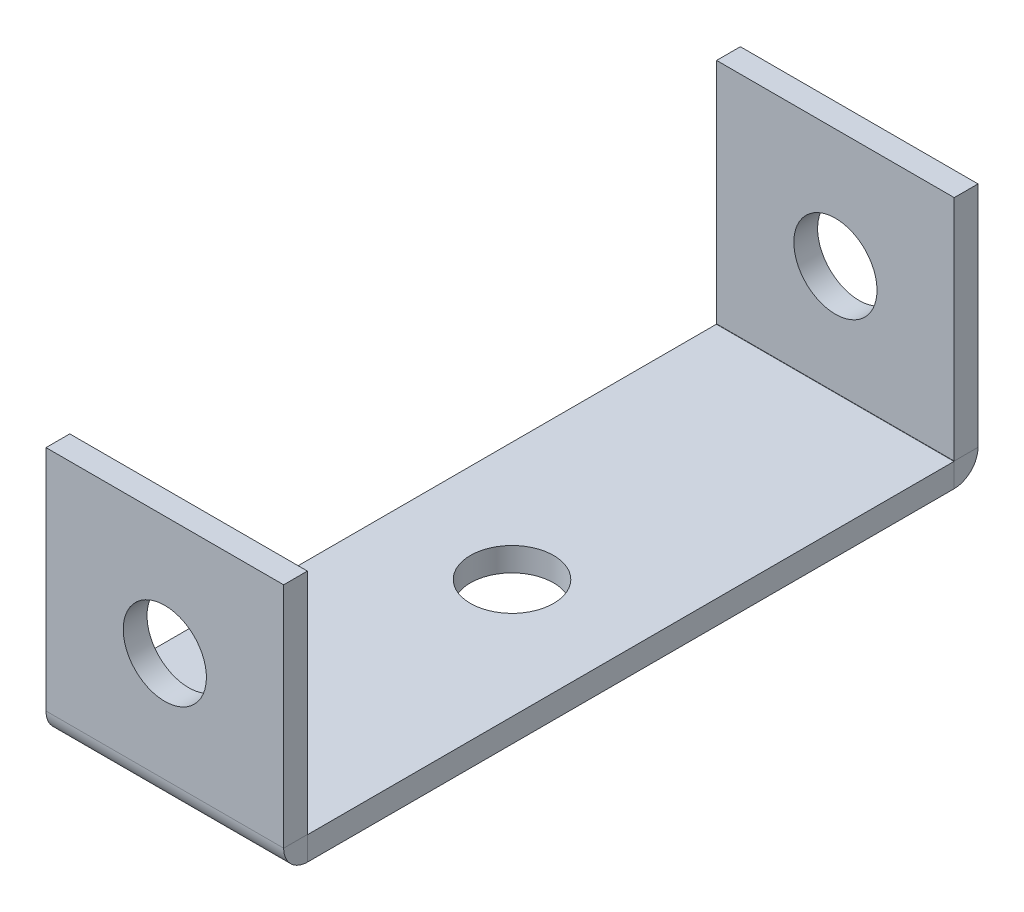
ISO-10303-21;
HEADER;
FILE_DESCRIPTION(('STEP AP214'),'2;1');
FILE_NAME('part.step','',(''),(''),'','','');
FILE_SCHEMA(('AUTOMOTIVE_DESIGN { 1 0 10303 214 1 1 1 1 }'));
ENDSEC;
DATA;
#1=APPLICATION_CONTEXT('core data for automotive mechanical design processes');
#2=APPLICATION_PROTOCOL_DEFINITION('international standard','automotive_design',2000,#1);
#3=PRODUCT_CONTEXT('',#1,'mechanical');
#4=PRODUCT('Part','Part','',(#3));
#5=PRODUCT_RELATED_PRODUCT_CATEGORY('part','',(#4));
#6=PRODUCT_DEFINITION_FORMATION('','',#4);
#7=PRODUCT_DEFINITION_CONTEXT('part definition',#1,'design');
#8=PRODUCT_DEFINITION('design','',#6,#7);
#9=PRODUCT_DEFINITION_SHAPE('','',#8);
#10=(LENGTH_UNIT() NAMED_UNIT(*) SI_UNIT(.MILLI.,.METRE.));
#11=(NAMED_UNIT(*) PLANE_ANGLE_UNIT() SI_UNIT($,.RADIAN.));
#12=(NAMED_UNIT(*) SI_UNIT($,.STERADIAN.) SOLID_ANGLE_UNIT());
#13=UNCERTAINTY_MEASURE_WITH_UNIT(LENGTH_MEASURE(1.E-05),#10,'distance_accuracy_value','');
#14=(GEOMETRIC_REPRESENTATION_CONTEXT(3) GLOBAL_UNCERTAINTY_ASSIGNED_CONTEXT((#13)) GLOBAL_UNIT_ASSIGNED_CONTEXT((#10,
#11,#12)) REPRESENTATION_CONTEXT('',''));
#15=CARTESIAN_POINT('',(0.,0.,0.));
#16=DIRECTION('',(0.,0.,1.));
#17=DIRECTION('',(1.,0.,0.));
#18=AXIS2_PLACEMENT_3D('',#15,#16,#17);
#19=CARTESIAN_POINT('',(0.,0.,-48.));
#20=DIRECTION('',(0.,-1.,0.));
#21=DIRECTION('',(0.,0.,-1.));
#22=AXIS2_PLACEMENT_3D('',#19,#20,#21);
#23=PLANE('',#22);
#24=CARTESIAN_POINT('',(5.,0.,-24.));
#25=DIRECTION('',(0.,1.,0.));
#26=DIRECTION('',(0.,0.,1.));
#27=AXIS2_PLACEMENT_3D('',#24,#25,#26);
#28=CIRCLE('',#27,1.75);
#29=CARTESIAN_POINT('',(5.,0.,-22.25));
#30=VERTEX_POINT('',#29);
#31=EDGE_CURVE('E226',#30,#30,#28,.T.);
#32=ORIENTED_EDGE('',*,*,#31,.T.);
#33=EDGE_LOOP('',(#32));
#34=FACE_BOUND('',#33,.T.);
#35=DIRECTION('',(0.,0.,1.));
#36=VECTOR('',#35,1.);
#37=CARTESIAN_POINT('',(0.,0.,0.));
#38=LINE('',#37,#36);
#39=CARTESIAN_POINT('',(0.,0.,-37.5994469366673));
#40=VERTEX_POINT('',#39);
#41=CARTESIAN_POINT('',(0.,7.28031480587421E-09,-10.4005530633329));
#42=VERTEX_POINT('',#41);
#43=EDGE_CURVE('E57',#40,#42,#38,.T.);
#44=ORIENTED_EDGE('',*,*,#43,.F.);
#45=DIRECTION('',(1.,0.,0.));
#46=VECTOR('',#45,1.);
#47=CARTESIAN_POINT('',(0.,0.,-37.5994469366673));
#48=LINE('',#47,#46);
#49=CARTESIAN_POINT('',(10.,0.,-37.5994469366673));
#50=VERTEX_POINT('',#49);
#51=EDGE_CURVE('E49',#40,#50,#48,.T.);
#52=ORIENTED_EDGE('',*,*,#51,.T.);
#53=DIRECTION('',(0.,0.,-1.));
#54=VECTOR('',#53,1.);
#55=CARTESIAN_POINT('',(10.,0.,0.));
#56=LINE('',#55,#54);
#57=CARTESIAN_POINT('',(10.,0.,-10.4005530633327));
#58=VERTEX_POINT('',#57);
#59=EDGE_CURVE('E65',#58,#50,#56,.T.);
#60=ORIENTED_EDGE('',*,*,#59,.F.);
#61=DIRECTION('',(1.,0.,0.));
#62=VECTOR('',#61,1.);
#63=CARTESIAN_POINT('',(0.,0.,-10.4005530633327));
#64=LINE('',#63,#62);
#65=EDGE_CURVE('E239',#42,#58,#64,.T.);
#66=ORIENTED_EDGE('',*,*,#65,.F.);
#67=EDGE_LOOP('',(#44,#52,#60,#66));
#68=FACE_BOUND('',#67,.T.);
#69=ADVANCED_FACE('F40',(#34,#68),#23,.T.);
#70=CARTESIAN_POINT('',(10.,1.,0.));
#71=DIRECTION('',(-1.,0.,0.));
#72=DIRECTION('',(0.,0.,1.));
#73=AXIS2_PLACEMENT_3D('',#70,#71,#72);
#74=PLANE('',#73);
#75=DIRECTION('',(0.,-1.,0.));
#76=VECTOR('',#75,1.);
#77=CARTESIAN_POINT('',(10.,0.999999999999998,-37.5994469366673));
#78=LINE('',#77,#76);
#79=CARTESIAN_POINT('',(10.,1.,-37.5994469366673));
#80=VERTEX_POINT('',#79);
#81=EDGE_CURVE('E246',#80,#50,#78,.T.);
#82=ORIENTED_EDGE('',*,*,#81,.F.);
#83=DIRECTION('',(0.,0.,-1.));
#84=VECTOR('',#83,1.);
#85=CARTESIAN_POINT('',(10.,1.,0.));
#86=LINE('',#85,#84);
#87=CARTESIAN_POINT('',(10.,1.00000000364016,-10.4005530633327));
#88=VERTEX_POINT('',#87);
#89=EDGE_CURVE('E236',#88,#80,#86,.T.);
#90=ORIENTED_EDGE('',*,*,#89,.F.);
#91=DIRECTION('',(0.,-1.,0.));
#92=VECTOR('',#91,1.);
#93=CARTESIAN_POINT('',(10.,0.999999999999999,-10.4005530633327));
#94=LINE('',#93,#92);
#95=EDGE_CURVE('E241',#88,#58,#94,.T.);
#96=ORIENTED_EDGE('',*,*,#95,.T.);
#97=ORIENTED_EDGE('',*,*,#59,.T.);
#98=EDGE_LOOP('',(#82,#90,#96,#97));
#99=FACE_BOUND('',#98,.T.);
#100=ADVANCED_FACE('F295',(#99),#74,.F.);
#101=CARTESIAN_POINT('',(0.,1.,0.));
#102=DIRECTION('',(1.,0.,0.));
#103=DIRECTION('',(0.,0.,-1.));
#104=AXIS2_PLACEMENT_3D('',#101,#102,#103);
#105=PLANE('',#104);
#106=DIRECTION('',(0.,1.,0.));
#107=VECTOR('',#106,1.);
#108=CARTESIAN_POINT('',(0.,0.999999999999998,-37.5994469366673));
#109=LINE('',#108,#107);
#110=CARTESIAN_POINT('',(0.,0.999999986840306,-37.5994469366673));
#111=VERTEX_POINT('',#110);
#112=EDGE_CURVE('E12',#40,#111,#109,.T.);
#113=ORIENTED_EDGE('',*,*,#112,.F.);
#114=ORIENTED_EDGE('',*,*,#43,.T.);
#115=DIRECTION('',(0.,1.,0.));
#116=VECTOR('',#115,1.);
#117=CARTESIAN_POINT('',(0.,0.999999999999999,-10.4005530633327));
#118=LINE('',#117,#116);
#119=CARTESIAN_POINT('',(0.,1.00000000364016,-10.4005530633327));
#120=VERTEX_POINT('',#119);
#121=EDGE_CURVE('E235',#42,#120,#118,.T.);
#122=ORIENTED_EDGE('',*,*,#121,.T.);
#123=DIRECTION('',(0.,0.,1.));
#124=VECTOR('',#123,1.);
#125=CARTESIAN_POINT('',(0.,1.,0.));
#126=LINE('',#125,#124);
#127=EDGE_CURVE('E44',#111,#120,#126,.T.);
#128=ORIENTED_EDGE('',*,*,#127,.F.);
#129=EDGE_LOOP('',(#113,#114,#122,#128));
#130=FACE_BOUND('',#129,.T.);
#131=ADVANCED_FACE('F42',(#130),#105,.F.);
#132=CARTESIAN_POINT('',(0.,1.,-48.));
#133=DIRECTION('',(0.,-1.,0.));
#134=DIRECTION('',(0.,0.,-1.));
#135=AXIS2_PLACEMENT_3D('',#132,#133,#134);
#136=PLANE('',#135);
#137=DIRECTION('',(1.,0.,0.));
#138=VECTOR('',#137,1.);
#139=CARTESIAN_POINT('',(0.,1.,-37.5994469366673));
#140=LINE('',#139,#138);
#141=EDGE_CURVE('E243',#111,#80,#140,.T.);
#142=ORIENTED_EDGE('',*,*,#141,.F.);
#143=ORIENTED_EDGE('',*,*,#127,.T.);
#144=DIRECTION('',(1.,0.,0.));
#145=VECTOR('',#144,1.);
#146=CARTESIAN_POINT('',(0.,1.,-10.4005530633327));
#147=LINE('',#146,#145);
#148=EDGE_CURVE('E232',#120,#88,#147,.T.);
#149=ORIENTED_EDGE('',*,*,#148,.T.);
#150=ORIENTED_EDGE('',*,*,#89,.T.);
#151=EDGE_LOOP('',(#142,#143,#149,#150));
#152=FACE_BOUND('',#151,.T.);
#153=CARTESIAN_POINT('',(5.,1.,-24.));
#154=DIRECTION('',(0.,1.,0.));
#155=DIRECTION('',(0.,0.,1.));
#156=AXIS2_PLACEMENT_3D('',#153,#154,#155);
#157=CIRCLE('',#156,1.75);
#158=CARTESIAN_POINT('',(5.,1.,-22.25));
#159=VERTEX_POINT('',#158);
#160=EDGE_CURVE('E229',#159,#159,#157,.T.);
#161=ORIENTED_EDGE('',*,*,#160,.F.);
#162=EDGE_LOOP('',(#161));
#163=FACE_BOUND('',#162,.T.);
#164=ADVANCED_FACE('F255',(#152,#163),#136,.F.);
#165=CARTESIAN_POINT('',(5.,1.,-24.));
#166=DIRECTION('',(0.,-1.,0.));
#167=DIRECTION('',(0.,0.,-1.));
#168=AXIS2_PLACEMENT_3D('',#165,#166,#167);
#169=CYLINDRICAL_SURFACE('',#168,1.75);
#170=ORIENTED_EDGE('',*,*,#160,.T.);
#171=EDGE_LOOP('',(#170));
#172=FACE_BOUND('',#171,.T.);
#173=ORIENTED_EDGE('',*,*,#31,.F.);
#174=EDGE_LOOP('',(#173));
#175=FACE_BOUND('',#174,.T.);
#176=ADVANCED_FACE('F304',(#172,#175),#169,.F.);
#177=CARTESIAN_POINT('',(0.,1.00999999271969,-10.4005530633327));
#178=DIRECTION('',(1.,0.,0.));
#179=DIRECTION('',(0.,0.,-1.));
#180=AXIS2_PLACEMENT_3D('',#177,#178,#179);
#181=PLANE('',#180);
#182=ORIENTED_EDGE('',*,*,#121,.F.);
#183=CARTESIAN_POINT('',(0.,1.01,-10.4005530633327));
#184=DIRECTION('',(1.,0.,0.));
#185=DIRECTION('',(0.,0.,-1.));
#186=AXIS2_PLACEMENT_3D('',#183,#184,#185);
#187=CIRCLE('',#186,1.00999999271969);
#188=CARTESIAN_POINT('',(0.,1.01,-9.3905530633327));
#189=VERTEX_POINT('',#188);
#190=EDGE_CURVE('E180',#42,#189,#187,.F.);
#191=ORIENTED_EDGE('',*,*,#190,.T.);
#192=DIRECTION('',(0.,0.,-1.));
#193=VECTOR('',#192,1.);
#194=CARTESIAN_POINT('',(0.,1.01,-10.3905530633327));
#195=LINE('',#194,#193);
#196=CARTESIAN_POINT('',(0.,1.01,-10.3905530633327));
#197=VERTEX_POINT('',#196);
#198=EDGE_CURVE('E207',#189,#197,#195,.T.);
#199=ORIENTED_EDGE('',*,*,#198,.T.);
#200=CARTESIAN_POINT('',(0.,1.00999999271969,-10.4005530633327));
#201=DIRECTION('',(-1.,0.,0.));
#202=DIRECTION('',(0.,0.,1.));
#203=AXIS2_PLACEMENT_3D('',#200,#201,#202);
#204=CIRCLE('',#203,0.00999998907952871);
#205=EDGE_CURVE('E218',#120,#197,#204,.T.);
#206=ORIENTED_EDGE('',*,*,#205,.F.);
#207=EDGE_LOOP('',(#182,#191,#199,#206));
#208=FACE_BOUND('',#207,.T.);
#209=ADVANCED_FACE('F261',(#208),#181,.F.);
#210=CARTESIAN_POINT('',(10.,1.00999999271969,-10.4005530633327));
#211=DIRECTION('',(-1.,0.,0.));
#212=DIRECTION('',(0.,0.,1.));
#213=AXIS2_PLACEMENT_3D('',#210,#211,#212);
#214=PLANE('',#213);
#215=DIRECTION('',(0.,0.,1.));
#216=VECTOR('',#215,1.);
#217=CARTESIAN_POINT('',(10.,1.01,-10.3905530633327));
#218=LINE('',#217,#216);
#219=CARTESIAN_POINT('',(10.,1.01,-10.390553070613));
#220=VERTEX_POINT('',#219);
#221=CARTESIAN_POINT('',(10.,1.01,-9.3905530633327));
#222=VERTEX_POINT('',#221);
#223=EDGE_CURVE('E210',#220,#222,#218,.T.);
#224=ORIENTED_EDGE('',*,*,#223,.T.);
#225=CARTESIAN_POINT('',(10.,1.01,-10.4005530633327));
#226=DIRECTION('',(1.,0.,0.));
#227=DIRECTION('',(0.,0.,-1.));
#228=AXIS2_PLACEMENT_3D('',#225,#226,#227);
#229=CIRCLE('',#228,1.00999999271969);
#230=EDGE_CURVE('E215',#222,#58,#229,.T.);
#231=ORIENTED_EDGE('',*,*,#230,.T.);
#232=ORIENTED_EDGE('',*,*,#95,.F.);
#233=CARTESIAN_POINT('',(10.,1.00999999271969,-10.4005530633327));
#234=DIRECTION('',(1.,0.,0.));
#235=DIRECTION('',(0.,0.,-1.));
#236=AXIS2_PLACEMENT_3D('',#233,#234,#235);
#237=CIRCLE('',#236,0.00999998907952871);
#238=EDGE_CURVE('E223',#220,#88,#237,.T.);
#239=ORIENTED_EDGE('',*,*,#238,.F.);
#240=EDGE_LOOP('',(#224,#231,#232,#239));
#241=FACE_BOUND('',#240,.T.);
#242=ADVANCED_FACE('F273',(#241),#214,.F.);
#243=CARTESIAN_POINT('',(-5.08175436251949,1.01,-10.4005530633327));
#244=DIRECTION('',(1.,0.,0.));
#245=DIRECTION('',(0.,0.,-1.));
#246=AXIS2_PLACEMENT_3D('',#243,#244,#245);
#247=CYLINDRICAL_SURFACE('',#246,0.00999999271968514);
#248=ORIENTED_EDGE('',*,*,#238,.T.);
#249=ORIENTED_EDGE('',*,*,#148,.F.);
#250=ORIENTED_EDGE('',*,*,#205,.T.);
#251=DIRECTION('',(1.,0.,0.));
#252=VECTOR('',#251,1.);
#253=CARTESIAN_POINT('',(0.,1.01,-10.3905530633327));
#254=LINE('',#253,#252);
#255=EDGE_CURVE('E177',#197,#220,#254,.T.);
#256=ORIENTED_EDGE('',*,*,#255,.T.);
#257=EDGE_LOOP('',(#248,#249,#250,#256));
#258=FACE_BOUND('',#257,.T.);
#259=ADVANCED_FACE('F284',(#258),#247,.F.);
#260=CARTESIAN_POINT('',(-5.08175436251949,1.01,-10.4005530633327));
#261=DIRECTION('',(1.,0.,0.));
#262=DIRECTION('',(0.,0.,-1.));
#263=AXIS2_PLACEMENT_3D('',#260,#261,#262);
#264=CYLINDRICAL_SURFACE('',#263,1.00999999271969);
#265=ORIENTED_EDGE('',*,*,#230,.F.);
#266=DIRECTION('',(1.,0.,0.));
#267=VECTOR('',#266,1.);
#268=CARTESIAN_POINT('',(0.,1.01,-9.3905530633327));
#269=LINE('',#268,#267);
#270=EDGE_CURVE('E184',#189,#222,#269,.T.);
#271=ORIENTED_EDGE('',*,*,#270,.F.);
#272=ORIENTED_EDGE('',*,*,#190,.F.);
#273=ORIENTED_EDGE('',*,*,#65,.T.);
#274=EDGE_LOOP('',(#265,#271,#272,#273));
#275=FACE_BOUND('',#274,.T.);
#276=ADVANCED_FACE('F265',(#275),#264,.T.);
#277=CARTESIAN_POINT('',(5.,5.6094469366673,-10.3905530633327));
#278=DIRECTION('',(0.,0.,1.));
#279=DIRECTION('',(0.,-1.,0.));
#280=AXIS2_PLACEMENT_3D('',#277,#278,#279);
#281=CYLINDRICAL_SURFACE('',#280,1.75);
#282=CARTESIAN_POINT('',(5.,5.6094469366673,-10.3905530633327));
#283=DIRECTION('',(0.,0.,-1.));
#284=DIRECTION('',(0.,1.,0.));
#285=AXIS2_PLACEMENT_3D('',#282,#283,#284);
#286=CIRCLE('',#285,1.75);
#287=CARTESIAN_POINT('',(5.,7.3594469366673,-10.3905530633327));
#288=VERTEX_POINT('',#287);
#289=EDGE_CURVE('E204',#288,#288,#286,.T.);
#290=ORIENTED_EDGE('',*,*,#289,.T.);
#291=EDGE_LOOP('',(#290));
#292=FACE_BOUND('',#291,.T.);
#293=CARTESIAN_POINT('',(5.,5.60944693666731,-9.39055306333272));
#294=DIRECTION('',(0.,0.,-1.));
#295=DIRECTION('',(0.,1.,0.));
#296=AXIS2_PLACEMENT_3D('',#293,#294,#295);
#297=CIRCLE('',#296,1.75);
#298=CARTESIAN_POINT('',(5.,7.35944693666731,-9.39055306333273));
#299=VERTEX_POINT('',#298);
#300=EDGE_CURVE('E187',#299,#299,#297,.T.);
#301=ORIENTED_EDGE('',*,*,#300,.F.);
#302=EDGE_LOOP('',(#301));
#303=FACE_BOUND('',#302,.T.);
#304=ADVANCED_FACE('F291',(#292,#303),#281,.F.);
#305=CARTESIAN_POINT('',(0.,10.6094469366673,-10.3905530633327));
#306=DIRECTION('',(0.,-1.,0.));
#307=DIRECTION('',(-1.,0.,0.));
#308=AXIS2_PLACEMENT_3D('',#305,#306,#307);
#309=PLANE('',#308);
#310=DIRECTION('',(1.,0.,0.));
#311=VECTOR('',#310,1.);
#312=CARTESIAN_POINT('',(0.,10.6094469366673,-9.39055306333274));
#313=LINE('',#312,#311);
#314=CARTESIAN_POINT('',(0.,10.6094469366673,-9.39055306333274));
#315=VERTEX_POINT('',#314);
#316=CARTESIAN_POINT('',(10.,10.6094469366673,-9.39055306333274));
#317=VERTEX_POINT('',#316);
#318=EDGE_CURVE('E202',#315,#317,#313,.T.);
#319=ORIENTED_EDGE('',*,*,#318,.T.);
#320=DIRECTION('',(0.,0.,1.));
#321=VECTOR('',#320,1.);
#322=CARTESIAN_POINT('',(10.,10.6094469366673,-10.3905530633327));
#323=LINE('',#322,#321);
#324=CARTESIAN_POINT('',(10.,10.6094469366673,-10.3905530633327));
#325=VERTEX_POINT('',#324);
#326=EDGE_CURVE('E181',#325,#317,#323,.T.);
#327=ORIENTED_EDGE('',*,*,#326,.F.);
#328=DIRECTION('',(1.,0.,0.));
#329=VECTOR('',#328,1.);
#330=CARTESIAN_POINT('',(0.,10.6094469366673,-10.3905530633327));
#331=LINE('',#330,#329);
#332=CARTESIAN_POINT('',(0.,10.6094469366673,-10.3905530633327));
#333=VERTEX_POINT('',#332);
#334=EDGE_CURVE('E195',#333,#325,#331,.T.);
#335=ORIENTED_EDGE('',*,*,#334,.F.);
#336=DIRECTION('',(0.,0.,1.));
#337=VECTOR('',#336,1.);
#338=CARTESIAN_POINT('',(0.,10.6094469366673,-10.3905530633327));
#339=LINE('',#338,#337);
#340=EDGE_CURVE('E199',#333,#315,#339,.T.);
#341=ORIENTED_EDGE('',*,*,#340,.T.);
#342=EDGE_LOOP('',(#319,#327,#335,#341));
#343=FACE_BOUND('',#342,.T.);
#344=ADVANCED_FACE('F341',(#343),#309,.F.);
#345=CARTESIAN_POINT('',(0.,-37.3905530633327,-10.3905530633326));
#346=DIRECTION('',(0.,0.,1.));
#347=DIRECTION('',(0.,-1.,0.));
#348=AXIS2_PLACEMENT_3D('',#345,#346,#347);
#349=PLANE('',#348);
#350=ORIENTED_EDGE('',*,*,#255,.F.);
#351=DIRECTION('',(0.,1.,0.));
#352=VECTOR('',#351,1.);
#353=CARTESIAN_POINT('',(0.,10.6094469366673,-10.3905530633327));
#354=LINE('',#353,#352);
#355=EDGE_CURVE('E197',#197,#333,#354,.T.);
#356=ORIENTED_EDGE('',*,*,#355,.T.);
#357=ORIENTED_EDGE('',*,*,#334,.T.);
#358=DIRECTION('',(0.,-1.,0.));
#359=VECTOR('',#358,1.);
#360=CARTESIAN_POINT('',(10.,10.6094469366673,-10.3905530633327));
#361=LINE('',#360,#359);
#362=EDGE_CURVE('E192',#325,#220,#361,.T.);
#363=ORIENTED_EDGE('',*,*,#362,.T.);
#364=EDGE_LOOP('',(#350,#356,#357,#363));
#365=FACE_BOUND('',#364,.T.);
#366=ORIENTED_EDGE('',*,*,#289,.F.);
#367=EDGE_LOOP('',(#366));
#368=FACE_BOUND('',#367,.T.);
#369=ADVANCED_FACE('F278',(#365,#368),#349,.F.);
#370=CARTESIAN_POINT('',(0.,10.6094469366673,-10.3905530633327));
#371=DIRECTION('',(1.,0.,0.));
#372=DIRECTION('',(0.,-1.,0.));
#373=AXIS2_PLACEMENT_3D('',#370,#371,#372);
#374=PLANE('',#373);
#375=ORIENTED_EDGE('',*,*,#198,.F.);
#376=DIRECTION('',(0.,1.,0.));
#377=VECTOR('',#376,1.);
#378=CARTESIAN_POINT('',(0.,10.6094469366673,-9.39055306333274));
#379=LINE('',#378,#377);
#380=EDGE_CURVE('E190',#189,#315,#379,.T.);
#381=ORIENTED_EDGE('',*,*,#380,.T.);
#382=ORIENTED_EDGE('',*,*,#340,.F.);
#383=ORIENTED_EDGE('',*,*,#355,.F.);
#384=EDGE_LOOP('',(#375,#381,#382,#383));
#385=FACE_BOUND('',#384,.T.);
#386=ADVANCED_FACE('F363',(#385),#374,.F.);
#387=CARTESIAN_POINT('',(0.,-37.3905530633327,-9.39055306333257));
#388=DIRECTION('',(0.,0.,1.));
#389=DIRECTION('',(0.,-1.,0.));
#390=AXIS2_PLACEMENT_3D('',#387,#388,#389);
#391=PLANE('',#390);
#392=ORIENTED_EDGE('',*,*,#300,.T.);
#393=EDGE_LOOP('',(#392));
#394=FACE_BOUND('',#393,.T.);
#395=ORIENTED_EDGE('',*,*,#380,.F.);
#396=ORIENTED_EDGE('',*,*,#270,.T.);
#397=DIRECTION('',(0.,-1.,0.));
#398=VECTOR('',#397,1.);
#399=CARTESIAN_POINT('',(10.,10.6094469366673,-9.39055306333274));
#400=LINE('',#399,#398);
#401=EDGE_CURVE('E178',#317,#222,#400,.T.);
#402=ORIENTED_EDGE('',*,*,#401,.F.);
#403=ORIENTED_EDGE('',*,*,#318,.F.);
#404=EDGE_LOOP('',(#395,#396,#402,#403));
#405=FACE_BOUND('',#404,.T.);
#406=ADVANCED_FACE('F268',(#394,#405),#391,.T.);
#407=CARTESIAN_POINT('',(10.,10.6094469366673,-10.3905530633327));
#408=DIRECTION('',(-1.,0.,0.));
#409=DIRECTION('',(0.,1.,0.));
#410=AXIS2_PLACEMENT_3D('',#407,#408,#409);
#411=PLANE('',#410);
#412=ORIENTED_EDGE('',*,*,#223,.F.);
#413=ORIENTED_EDGE('',*,*,#362,.F.);
#414=ORIENTED_EDGE('',*,*,#326,.T.);
#415=ORIENTED_EDGE('',*,*,#401,.T.);
#416=EDGE_LOOP('',(#412,#413,#414,#415));
#417=FACE_BOUND('',#416,.T.);
#418=ADVANCED_FACE('F276',(#417),#411,.F.);
#419=CARTESIAN_POINT('',(0.,1.01000002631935,-37.5994469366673));
#420=DIRECTION('',(1.,0.,0.));
#421=DIRECTION('',(0.,0.,-1.));
#422=AXIS2_PLACEMENT_3D('',#419,#420,#421);
#423=PLANE('',#422);
#424=DIRECTION('',(0.,0.,1.));
#425=VECTOR('',#424,1.);
#426=CARTESIAN_POINT('',(0.,1.01,-37.6094469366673));
#427=LINE('',#426,#425);
#428=CARTESIAN_POINT('',(0.,1.01,-38.6094469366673));
#429=VERTEX_POINT('',#428);
#430=CARTESIAN_POINT('',(0.,1.01,-37.6094469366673));
#431=VERTEX_POINT('',#430);
#432=EDGE_CURVE('E561',#429,#431,#427,.T.);
#433=ORIENTED_EDGE('',*,*,#432,.F.);
#434=CARTESIAN_POINT('',(0.,1.01,-37.5994469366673));
#435=DIRECTION('',(-1.,0.,0.));
#436=DIRECTION('',(0.,0.,1.));
#437=AXIS2_PLACEMENT_3D('',#434,#435,#436);
#438=CIRCLE('',#437,1.01000002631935);
#439=EDGE_CURVE('E168',#429,#40,#438,.T.);
#440=ORIENTED_EDGE('',*,*,#439,.T.);
#441=ORIENTED_EDGE('',*,*,#112,.T.);
#442=CARTESIAN_POINT('',(0.,1.01000002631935,-37.5994469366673));
#443=DIRECTION('',(-1.,0.,0.));
#444=DIRECTION('',(0.,0.,1.));
#445=AXIS2_PLACEMENT_3D('',#442,#443,#444);
#446=CIRCLE('',#445,0.010000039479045);
#447=EDGE_CURVE('E167',#431,#111,#446,.T.);
#448=ORIENTED_EDGE('',*,*,#447,.F.);
#449=EDGE_LOOP('',(#433,#440,#441,#448));
#450=FACE_BOUND('',#449,.T.);
#451=ADVANCED_FACE('F393',(#450),#423,.F.);
#452=CARTESIAN_POINT('',(10.,1.01000002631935,-37.5994469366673));
#453=DIRECTION('',(-1.,0.,0.));
#454=DIRECTION('',(0.,0.,1.));
#455=AXIS2_PLACEMENT_3D('',#452,#453,#454);
#456=PLANE('',#455);
#457=ORIENTED_EDGE('',*,*,#81,.T.);
#458=CARTESIAN_POINT('',(10.,1.01,-37.5994469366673));
#459=DIRECTION('',(-1.,0.,0.));
#460=DIRECTION('',(0.,0.,1.));
#461=AXIS2_PLACEMENT_3D('',#458,#459,#460);
#462=CIRCLE('',#461,1.01000002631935);
#463=CARTESIAN_POINT('',(10.,1.01,-38.6094469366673));
#464=VERTEX_POINT('',#463);
#465=EDGE_CURVE('E165',#50,#464,#462,.F.);
#466=ORIENTED_EDGE('',*,*,#465,.T.);
#467=DIRECTION('',(0.,0.,-1.));
#468=VECTOR('',#467,1.);
#469=CARTESIAN_POINT('',(10.,1.01,-37.6094469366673));
#470=LINE('',#469,#468);
#471=CARTESIAN_POINT('',(10.,1.00999999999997,-37.6094469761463));
#472=VERTEX_POINT('',#471);
#473=EDGE_CURVE('E140',#472,#464,#470,.T.);
#474=ORIENTED_EDGE('',*,*,#473,.F.);
#475=CARTESIAN_POINT('',(10.,1.01000002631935,-37.5994469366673));
#476=DIRECTION('',(1.,0.,0.));
#477=DIRECTION('',(0.,0.,-1.));
#478=AXIS2_PLACEMENT_3D('',#475,#476,#477);
#479=CIRCLE('',#478,0.010000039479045);
#480=EDGE_CURVE('E174',#80,#472,#479,.T.);
#481=ORIENTED_EDGE('',*,*,#480,.F.);
#482=EDGE_LOOP('',(#457,#466,#474,#481));
#483=FACE_BOUND('',#482,.T.);
#484=ADVANCED_FACE('F403',(#483),#456,.F.);
#485=CARTESIAN_POINT('',(15.0817543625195,1.01,-37.5994469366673));
#486=DIRECTION('',(-1.,0.,0.));
#487=DIRECTION('',(0.,0.,1.));
#488=AXIS2_PLACEMENT_3D('',#485,#486,#487);
#489=CYLINDRICAL_SURFACE('',#488,0.0100000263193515);
#490=ORIENTED_EDGE('',*,*,#480,.T.);
#491=DIRECTION('',(1.,0.,0.));
#492=VECTOR('',#491,1.);
#493=CARTESIAN_POINT('',(0.,1.01,-37.6094469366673));
#494=LINE('',#493,#492);
#495=EDGE_CURVE('E571',#431,#472,#494,.T.);
#496=ORIENTED_EDGE('',*,*,#495,.F.);
#497=ORIENTED_EDGE('',*,*,#447,.T.);
#498=ORIENTED_EDGE('',*,*,#141,.T.);
#499=EDGE_LOOP('',(#490,#496,#497,#498));
#500=FACE_BOUND('',#499,.T.);
#501=ADVANCED_FACE('F414',(#500),#489,.F.);
#502=CARTESIAN_POINT('',(15.0817543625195,1.01,-37.5994469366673));
#503=DIRECTION('',(-1.,0.,0.));
#504=DIRECTION('',(0.,0.,1.));
#505=AXIS2_PLACEMENT_3D('',#502,#503,#504);
#506=CYLINDRICAL_SURFACE('',#505,1.01000002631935);
#507=ORIENTED_EDGE('',*,*,#465,.F.);
#508=ORIENTED_EDGE('',*,*,#51,.F.);
#509=ORIENTED_EDGE('',*,*,#439,.F.);
#510=DIRECTION('',(1.,0.,0.));
#511=VECTOR('',#510,1.);
#512=CARTESIAN_POINT('',(0.,1.01,-38.6094469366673));
#513=LINE('',#512,#511);
#514=EDGE_CURVE('E159',#429,#464,#513,.T.);
#515=ORIENTED_EDGE('',*,*,#514,.T.);
#516=EDGE_LOOP('',(#507,#508,#509,#515));
#517=FACE_BOUND('',#516,.T.);
#518=ADVANCED_FACE('F425',(#517),#506,.T.);
#519=CARTESIAN_POINT('',(0.,10.6094469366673,-37.6094469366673));
#520=DIRECTION('',(0.,-1.,0.));
#521=DIRECTION('',(1.,0.,0.));
#522=AXIS2_PLACEMENT_3D('',#519,#520,#521);
#523=PLANE('',#522);
#524=DIRECTION('',(-1.,0.,0.));
#525=VECTOR('',#524,1.);
#526=CARTESIAN_POINT('',(0.,10.6094469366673,-38.6094469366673));
#527=LINE('',#526,#525);
#528=CARTESIAN_POINT('',(10.,10.6094469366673,-38.6094469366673));
#529=VERTEX_POINT('',#528);
#530=CARTESIAN_POINT('',(0.,10.6094469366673,-38.6094469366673));
#531=VERTEX_POINT('',#530);
#532=EDGE_CURVE('E150',#529,#531,#527,.T.);
#533=ORIENTED_EDGE('',*,*,#532,.T.);
#534=DIRECTION('',(0.,0.,-1.));
#535=VECTOR('',#534,1.);
#536=CARTESIAN_POINT('',(0.,10.6094469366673,-37.6094469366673));
#537=LINE('',#536,#535);
#538=CARTESIAN_POINT('',(0.,10.6094469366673,-37.6094469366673));
#539=VERTEX_POINT('',#538);
#540=EDGE_CURVE('E171',#539,#531,#537,.T.);
#541=ORIENTED_EDGE('',*,*,#540,.F.);
#542=DIRECTION('',(-1.,0.,0.));
#543=VECTOR('',#542,1.);
#544=CARTESIAN_POINT('',(0.,10.6094469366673,-37.6094469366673));
#545=LINE('',#544,#543);
#546=CARTESIAN_POINT('',(10.,10.6094469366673,-37.6094469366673));
#547=VERTEX_POINT('',#546);
#548=EDGE_CURVE('E152',#547,#539,#545,.T.);
#549=ORIENTED_EDGE('',*,*,#548,.F.);
#550=DIRECTION('',(0.,0.,-1.));
#551=VECTOR('',#550,1.);
#552=CARTESIAN_POINT('',(10.,10.6094469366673,-37.6094469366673));
#553=LINE('',#552,#551);
#554=EDGE_CURVE('E137',#547,#529,#553,.T.);
#555=ORIENTED_EDGE('',*,*,#554,.T.);
#556=EDGE_LOOP('',(#533,#541,#549,#555));
#557=FACE_BOUND('',#556,.T.);
#558=ADVANCED_FACE('F148',(#557),#523,.F.);
#559=CARTESIAN_POINT('',(5.,5.6094469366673,-37.6094469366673));
#560=DIRECTION('',(0.,0.,-1.));
#561=DIRECTION('',(0.,1.,0.));
#562=AXIS2_PLACEMENT_3D('',#559,#560,#561);
#563=CYLINDRICAL_SURFACE('',#562,1.75);
#564=CARTESIAN_POINT('',(5.,5.6094469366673,-37.6094469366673));
#565=DIRECTION('',(0.,0.,1.));
#566=DIRECTION('',(0.,-1.,0.));
#567=AXIS2_PLACEMENT_3D('',#564,#565,#566);
#568=CIRCLE('',#567,1.75);
#569=CARTESIAN_POINT('',(5.,3.8594469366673,-37.6094469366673));
#570=VERTEX_POINT('',#569);
#571=EDGE_CURVE('E153',#570,#570,#568,.T.);
#572=ORIENTED_EDGE('',*,*,#571,.T.);
#573=EDGE_LOOP('',(#572));
#574=FACE_BOUND('',#573,.T.);
#575=CARTESIAN_POINT('',(5.,5.60944693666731,-38.6094469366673));
#576=DIRECTION('',(0.,0.,1.));
#577=DIRECTION('',(0.,-1.,0.));
#578=AXIS2_PLACEMENT_3D('',#575,#576,#577);
#579=CIRCLE('',#578,1.75);
#580=CARTESIAN_POINT('',(5.,3.85944693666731,-38.6094469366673));
#581=VERTEX_POINT('',#580);
#582=EDGE_CURVE('E145',#581,#581,#579,.T.);
#583=ORIENTED_EDGE('',*,*,#582,.F.);
#584=EDGE_LOOP('',(#583));
#585=FACE_BOUND('',#584,.T.);
#586=ADVANCED_FACE('F446',(#574,#585),#563,.F.);
#587=CARTESIAN_POINT('',(0.,10.6094469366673,-37.6094469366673));
#588=DIRECTION('',(0.,0.,-1.));
#589=DIRECTION('',(0.,1.,0.));
#590=AXIS2_PLACEMENT_3D('',#587,#588,#589);
#591=PLANE('',#590);
#592=ORIENTED_EDGE('',*,*,#571,.F.);
#593=EDGE_LOOP('',(#592));
#594=FACE_BOUND('',#593,.T.);
#595=DIRECTION('',(0.,-1.,0.));
#596=VECTOR('',#595,1.);
#597=CARTESIAN_POINT('',(0.,-37.3905530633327,-37.6094469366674));
#598=LINE('',#597,#596);
#599=EDGE_CURVE('E574',#539,#431,#598,.T.);
#600=ORIENTED_EDGE('',*,*,#599,.T.);
#601=ORIENTED_EDGE('',*,*,#495,.T.);
#602=DIRECTION('',(0.,1.,0.));
#603=VECTOR('',#602,1.);
#604=CARTESIAN_POINT('',(10.,-37.3905530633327,-37.6094469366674));
#605=LINE('',#604,#603);
#606=EDGE_CURVE('E573',#472,#547,#605,.T.);
#607=ORIENTED_EDGE('',*,*,#606,.T.);
#608=ORIENTED_EDGE('',*,*,#548,.T.);
#609=EDGE_LOOP('',(#600,#601,#607,#608));
#610=FACE_BOUND('',#609,.T.);
#611=ADVANCED_FACE('F456',(#594,#610),#591,.F.);
#612=CARTESIAN_POINT('',(10.,-37.3905530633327,-37.6094469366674));
#613=DIRECTION('',(-1.,0.,0.));
#614=DIRECTION('',(0.,-1.,0.));
#615=AXIS2_PLACEMENT_3D('',#612,#613,#614);
#616=PLANE('',#615);
#617=ORIENTED_EDGE('',*,*,#606,.F.);
#618=ORIENTED_EDGE('',*,*,#473,.T.);
#619=DIRECTION('',(0.,1.,0.));
#620=VECTOR('',#619,1.);
#621=CARTESIAN_POINT('',(10.,-37.3905530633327,-38.6094469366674));
#622=LINE('',#621,#620);
#623=EDGE_CURVE('E134',#464,#529,#622,.T.);
#624=ORIENTED_EDGE('',*,*,#623,.T.);
#625=ORIENTED_EDGE('',*,*,#554,.F.);
#626=EDGE_LOOP('',(#617,#618,#624,#625));
#627=FACE_BOUND('',#626,.T.);
#628=ADVANCED_FACE('F136',(#627),#616,.F.);
#629=CARTESIAN_POINT('',(0.,10.6094469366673,-38.6094469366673));
#630=DIRECTION('',(0.,0.,-1.));
#631=DIRECTION('',(0.,1.,0.));
#632=AXIS2_PLACEMENT_3D('',#629,#630,#631);
#633=PLANE('',#632);
#634=ORIENTED_EDGE('',*,*,#514,.F.);
#635=DIRECTION('',(0.,-1.,0.));
#636=VECTOR('',#635,1.);
#637=CARTESIAN_POINT('',(0.,-37.3905530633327,-38.6094469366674));
#638=LINE('',#637,#636);
#639=EDGE_CURVE('E158',#531,#429,#638,.T.);
#640=ORIENTED_EDGE('',*,*,#639,.F.);
#641=ORIENTED_EDGE('',*,*,#532,.F.);
#642=ORIENTED_EDGE('',*,*,#623,.F.);
#643=EDGE_LOOP('',(#634,#640,#641,#642));
#644=FACE_BOUND('',#643,.T.);
#645=ORIENTED_EDGE('',*,*,#582,.T.);
#646=EDGE_LOOP('',(#645));
#647=FACE_BOUND('',#646,.T.);
#648=ADVANCED_FACE('F156',(#644,#647),#633,.T.);
#649=CARTESIAN_POINT('',(0.,-37.3905530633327,-37.6094469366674));
#650=DIRECTION('',(1.,0.,0.));
#651=DIRECTION('',(0.,1.,0.));
#652=AXIS2_PLACEMENT_3D('',#649,#650,#651);
#653=PLANE('',#652);
#654=ORIENTED_EDGE('',*,*,#639,.T.);
#655=ORIENTED_EDGE('',*,*,#432,.T.);
#656=ORIENTED_EDGE('',*,*,#599,.F.);
#657=ORIENTED_EDGE('',*,*,#540,.T.);
#658=EDGE_LOOP('',(#654,#655,#656,#657));
#659=FACE_BOUND('',#658,.T.);
#660=ADVANCED_FACE('F486',(#659),#653,.F.);
#661=CLOSED_SHELL('',(#69,#100,#131,#164,#176,#209,#242,#259,#276,#304,#344,#369,#386,#406,#418,
#451,#484,#501,#518,#558,#586,#611,#628,#648,#660));
#662=MANIFOLD_SOLID_BREP('B2',#661);
#663=ADVANCED_BREP_SHAPE_REPRESENTATION('',(#18,#662),#14);
#664=SHAPE_DEFINITION_REPRESENTATION(#9,#663);
ENDSEC;
END-ISO-10303-21;
